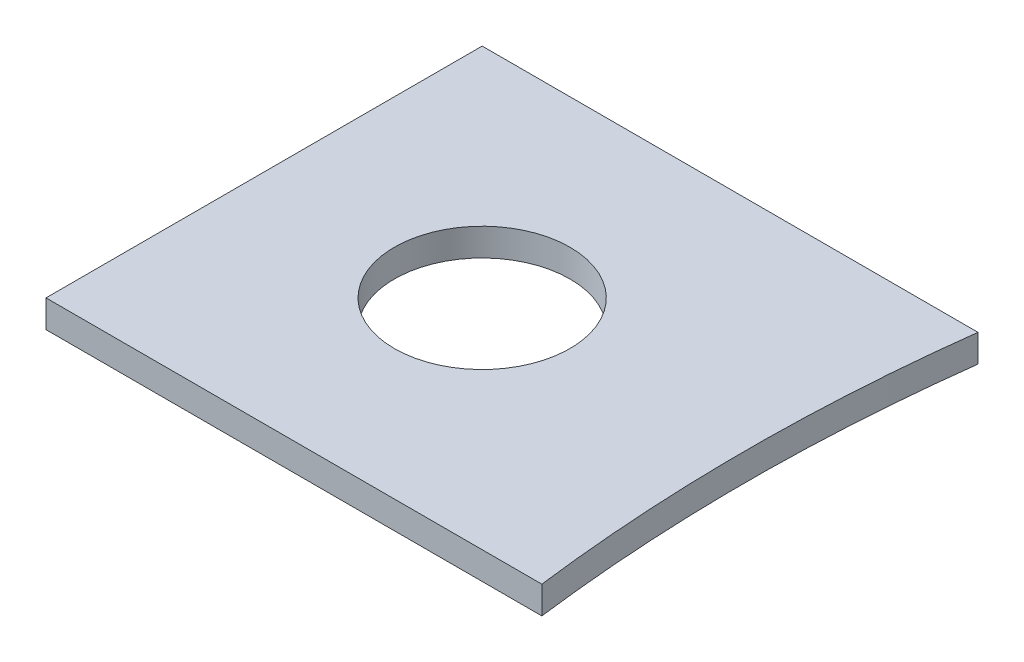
ISO-10303-21;
HEADER;
FILE_DESCRIPTION(('STEP AP214'),'2;1');
FILE_NAME('part.step','',(''),(''),'','','');
FILE_SCHEMA(('AUTOMOTIVE_DESIGN { 1 0 10303 214 1 1 1 1 }'));
ENDSEC;
DATA;
#1=APPLICATION_CONTEXT('core data for automotive mechanical design processes');
#2=APPLICATION_PROTOCOL_DEFINITION('international standard','automotive_design',2000,#1);
#3=PRODUCT_CONTEXT('',#1,'mechanical');
#4=PRODUCT('Part','Part','',(#3));
#5=PRODUCT_RELATED_PRODUCT_CATEGORY('part','',(#4));
#6=PRODUCT_DEFINITION_FORMATION('','',#4);
#7=PRODUCT_DEFINITION_CONTEXT('part definition',#1,'design');
#8=PRODUCT_DEFINITION('design','',#6,#7);
#9=PRODUCT_DEFINITION_SHAPE('','',#8);
#10=(LENGTH_UNIT() NAMED_UNIT(*) SI_UNIT(.MILLI.,.METRE.));
#11=(NAMED_UNIT(*) PLANE_ANGLE_UNIT() SI_UNIT($,.RADIAN.));
#12=(NAMED_UNIT(*) SI_UNIT($,.STERADIAN.) SOLID_ANGLE_UNIT());
#13=UNCERTAINTY_MEASURE_WITH_UNIT(LENGTH_MEASURE(1.E-05),#10,'distance_accuracy_value','');
#14=(GEOMETRIC_REPRESENTATION_CONTEXT(3) GLOBAL_UNCERTAINTY_ASSIGNED_CONTEXT((#13)) GLOBAL_UNIT_ASSIGNED_CONTEXT((#10,
#11,#12)) REPRESENTATION_CONTEXT('',''));
#15=CARTESIAN_POINT('',(0.,0.,0.));
#16=DIRECTION('',(0.,0.,1.));
#17=DIRECTION('',(1.,0.,0.));
#18=AXIS2_PLACEMENT_3D('',#15,#16,#17);
#19=CARTESIAN_POINT('',(963.99131010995,12.,-94.9999999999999));
#20=DIRECTION('',(0.,1.,0.));
#21=DIRECTION('',(0.,0.,1.));
#22=AXIS2_PLACEMENT_3D('',#19,#20,#21);
#23=PLANE('',#22);
#24=DIRECTION('',(1.,0.,0.));
#25=VECTOR('',#24,1.);
#26=CARTESIAN_POINT('',(0.,12.,0.));
#27=LINE('',#26,#25);
#28=CARTESIAN_POINT('',(0.,12.,0.));
#29=VERTEX_POINT('',#28);
#30=CARTESIAN_POINT('',(216.,12.,-3.33066907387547E-13));
#31=VERTEX_POINT('',#30);
#32=EDGE_CURVE('E94',#29,#31,#27,.T.);
#33=ORIENTED_EDGE('',*,*,#32,.T.);
#34=CARTESIAN_POINT('',(963.99131010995,12.,-94.9999999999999));
#35=DIRECTION('',(0.,-1.,0.));
#36=DIRECTION('',(0.,0.,1.));
#37=AXIS2_PLACEMENT_3D('',#34,#35,#36);
#38=CIRCLE('',#37,754.);
#39=CARTESIAN_POINT('',(216.,12.,-190.));
#40=VERTEX_POINT('',#39);
#41=EDGE_CURVE('E89',#31,#40,#38,.T.);
#42=ORIENTED_EDGE('',*,*,#41,.T.);
#43=DIRECTION('',(-1.,0.,0.));
#44=VECTOR('',#43,1.);
#45=CARTESIAN_POINT('',(0.,12.,-190.));
#46=LINE('',#45,#44);
#47=CARTESIAN_POINT('',(0.,12.,-190.));
#48=VERTEX_POINT('',#47);
#49=EDGE_CURVE('E92',#40,#48,#46,.T.);
#50=ORIENTED_EDGE('',*,*,#49,.T.);
#51=DIRECTION('',(0.,0.,1.));
#52=VECTOR('',#51,1.);
#53=CARTESIAN_POINT('',(0.,12.,0.));
#54=LINE('',#53,#52);
#55=EDGE_CURVE('E59',#48,#29,#54,.T.);
#56=ORIENTED_EDGE('',*,*,#55,.T.);
#57=EDGE_LOOP('',(#33,#42,#50,#56));
#58=FACE_BOUND('',#57,.T.);
#59=CARTESIAN_POINT('',(95.,12.,-94.9999999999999));
#60=DIRECTION('',(0.,1.,0.));
#61=DIRECTION('',(0.,0.,1.));
#62=AXIS2_PLACEMENT_3D('',#59,#60,#61);
#63=CIRCLE('',#62,38.25);
#64=CARTESIAN_POINT('',(95.,12.,-56.7499999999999));
#65=VERTEX_POINT('',#64);
#66=EDGE_CURVE('E109',#65,#65,#63,.T.);
#67=ORIENTED_EDGE('',*,*,#66,.F.);
#68=EDGE_LOOP('',(#67));
#69=FACE_BOUND('',#68,.T.);
#70=ADVANCED_FACE('F42',(#58,#69),#23,.T.);
#71=CARTESIAN_POINT('',(963.99131010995,0.,-94.9999999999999));
#72=DIRECTION('',(0.,1.,0.));
#73=DIRECTION('',(0.,0.,1.));
#74=AXIS2_PLACEMENT_3D('',#71,#72,#73);
#75=PLANE('',#74);
#76=DIRECTION('',(1.,0.,0.));
#77=VECTOR('',#76,1.);
#78=CARTESIAN_POINT('',(0.,0.,0.));
#79=LINE('',#78,#77);
#80=CARTESIAN_POINT('',(0.,0.,0.));
#81=VERTEX_POINT('',#80);
#82=CARTESIAN_POINT('',(216.,0.,-3.33066907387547E-13));
#83=VERTEX_POINT('',#82);
#84=EDGE_CURVE('E106',#81,#83,#79,.T.);
#85=ORIENTED_EDGE('',*,*,#84,.F.);
#86=DIRECTION('',(0.,0.,1.));
#87=VECTOR('',#86,1.);
#88=CARTESIAN_POINT('',(0.,0.,0.));
#89=LINE('',#88,#87);
#90=CARTESIAN_POINT('',(0.,0.,-190.));
#91=VERTEX_POINT('',#90);
#92=EDGE_CURVE('E82',#91,#81,#89,.T.);
#93=ORIENTED_EDGE('',*,*,#92,.F.);
#94=DIRECTION('',(-1.,0.,0.));
#95=VECTOR('',#94,1.);
#96=CARTESIAN_POINT('',(0.,0.,-190.));
#97=LINE('',#96,#95);
#98=CARTESIAN_POINT('',(216.,0.,-190.));
#99=VERTEX_POINT('',#98);
#100=EDGE_CURVE('E76',#99,#91,#97,.T.);
#101=ORIENTED_EDGE('',*,*,#100,.F.);
#102=CARTESIAN_POINT('',(963.99131010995,0.,-94.9999999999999));
#103=DIRECTION('',(0.,-1.,0.));
#104=DIRECTION('',(0.,0.,1.));
#105=AXIS2_PLACEMENT_3D('',#102,#103,#104);
#106=CIRCLE('',#105,754.);
#107=EDGE_CURVE('E98',#83,#99,#106,.T.);
#108=ORIENTED_EDGE('',*,*,#107,.F.);
#109=EDGE_LOOP('',(#85,#93,#101,#108));
#110=FACE_BOUND('',#109,.T.);
#111=CARTESIAN_POINT('',(95.,0.,-94.9999999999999));
#112=DIRECTION('',(0.,1.,0.));
#113=DIRECTION('',(0.,0.,1.));
#114=AXIS2_PLACEMENT_3D('',#111,#112,#113);
#115=CIRCLE('',#114,38.25);
#116=CARTESIAN_POINT('',(95.,0.,-56.7499999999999));
#117=VERTEX_POINT('',#116);
#118=EDGE_CURVE('E121',#117,#117,#115,.T.);
#119=ORIENTED_EDGE('',*,*,#118,.T.);
#120=EDGE_LOOP('',(#119));
#121=FACE_BOUND('',#120,.T.);
#122=ADVANCED_FACE('F117',(#110,#121),#75,.F.);
#123=CARTESIAN_POINT('',(0.,12.,0.));
#124=DIRECTION('',(0.,0.,-1.));
#125=DIRECTION('',(-1.,0.,0.));
#126=AXIS2_PLACEMENT_3D('',#123,#124,#125);
#127=PLANE('',#126);
#128=ORIENTED_EDGE('',*,*,#84,.T.);
#129=DIRECTION('',(0.,-1.,0.));
#130=VECTOR('',#129,1.);
#131=CARTESIAN_POINT('',(216.,12.,-3.33066907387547E-13));
#132=LINE('',#131,#130);
#133=EDGE_CURVE('E13',#31,#83,#132,.T.);
#134=ORIENTED_EDGE('',*,*,#133,.F.);
#135=ORIENTED_EDGE('',*,*,#32,.F.);
#136=DIRECTION('',(0.,-1.,0.));
#137=VECTOR('',#136,1.);
#138=CARTESIAN_POINT('',(0.,12.,0.));
#139=LINE('',#138,#137);
#140=EDGE_CURVE('E102',#29,#81,#139,.T.);
#141=ORIENTED_EDGE('',*,*,#140,.T.);
#142=EDGE_LOOP('',(#128,#134,#135,#141));
#143=FACE_BOUND('',#142,.T.);
#144=ADVANCED_FACE('F44',(#143),#127,.F.);
#145=CARTESIAN_POINT('',(963.99131010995,12.,-94.9999999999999));
#146=DIRECTION('',(0.,-1.,0.));
#147=DIRECTION('',(0.,0.,-1.));
#148=AXIS2_PLACEMENT_3D('',#145,#146,#147);
#149=CYLINDRICAL_SURFACE('',#148,754.);
#150=ORIENTED_EDGE('',*,*,#107,.T.);
#151=DIRECTION('',(0.,-1.,0.));
#152=VECTOR('',#151,1.);
#153=CARTESIAN_POINT('',(216.,12.,-190.));
#154=LINE('',#153,#152);
#155=EDGE_CURVE('E51',#40,#99,#154,.T.);
#156=ORIENTED_EDGE('',*,*,#155,.F.);
#157=ORIENTED_EDGE('',*,*,#41,.F.);
#158=ORIENTED_EDGE('',*,*,#133,.T.);
#159=EDGE_LOOP('',(#150,#156,#157,#158));
#160=FACE_BOUND('',#159,.T.);
#161=ADVANCED_FACE('F97',(#160),#149,.F.);
#162=CARTESIAN_POINT('',(0.,12.,-190.));
#163=DIRECTION('',(0.,0.,1.));
#164=DIRECTION('',(1.,0.,0.));
#165=AXIS2_PLACEMENT_3D('',#162,#163,#164);
#166=PLANE('',#165);
#167=ORIENTED_EDGE('',*,*,#100,.T.);
#168=DIRECTION('',(0.,-1.,0.));
#169=VECTOR('',#168,1.);
#170=CARTESIAN_POINT('',(0.,12.,-190.));
#171=LINE('',#170,#169);
#172=EDGE_CURVE('E99',#48,#91,#171,.T.);
#173=ORIENTED_EDGE('',*,*,#172,.F.);
#174=ORIENTED_EDGE('',*,*,#49,.F.);
#175=ORIENTED_EDGE('',*,*,#155,.T.);
#176=EDGE_LOOP('',(#167,#173,#174,#175));
#177=FACE_BOUND('',#176,.T.);
#178=ADVANCED_FACE('F100',(#177),#166,.F.);
#179=CARTESIAN_POINT('',(0.,12.,0.));
#180=DIRECTION('',(1.,0.,0.));
#181=DIRECTION('',(0.,0.,-1.));
#182=AXIS2_PLACEMENT_3D('',#179,#180,#181);
#183=PLANE('',#182);
#184=ORIENTED_EDGE('',*,*,#92,.T.);
#185=ORIENTED_EDGE('',*,*,#140,.F.);
#186=ORIENTED_EDGE('',*,*,#55,.F.);
#187=ORIENTED_EDGE('',*,*,#172,.T.);
#188=EDGE_LOOP('',(#184,#185,#186,#187));
#189=FACE_BOUND('',#188,.T.);
#190=ADVANCED_FACE('F114',(#189),#183,.F.);
#191=CARTESIAN_POINT('',(95.,12.,-94.9999999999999));
#192=DIRECTION('',(0.,-1.,0.));
#193=DIRECTION('',(0.,0.,-1.));
#194=AXIS2_PLACEMENT_3D('',#191,#192,#193);
#195=CYLINDRICAL_SURFACE('',#194,38.25);
#196=ORIENTED_EDGE('',*,*,#66,.T.);
#197=EDGE_LOOP('',(#196));
#198=FACE_BOUND('',#197,.T.);
#199=ORIENTED_EDGE('',*,*,#118,.F.);
#200=EDGE_LOOP('',(#199));
#201=FACE_BOUND('',#200,.T.);
#202=ADVANCED_FACE('F127',(#198,#201),#195,.F.);
#203=CLOSED_SHELL('',(#70,#122,#144,#161,#178,#190,#202));
#204=MANIFOLD_SOLID_BREP('B2',#203);
#205=ADVANCED_BREP_SHAPE_REPRESENTATION('',(#18,#204),#14);
#206=SHAPE_DEFINITION_REPRESENTATION(#9,#205);
ENDSEC;
END-ISO-10303-21;
